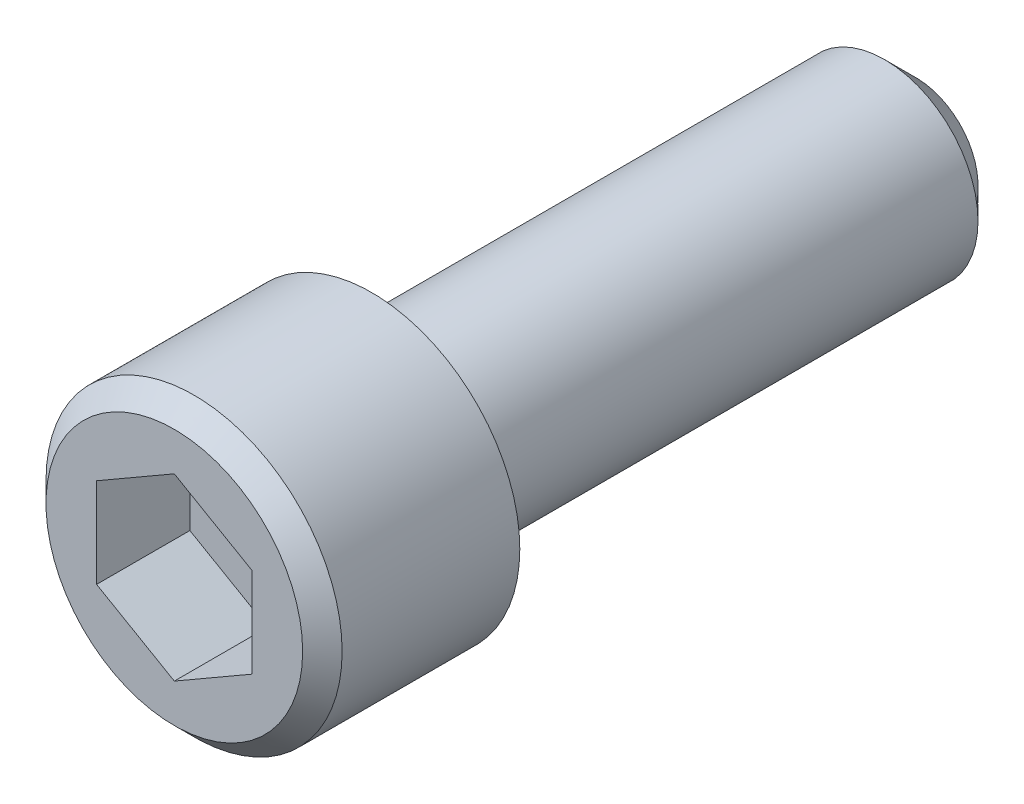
ISO-10303-21;
HEADER;
FILE_DESCRIPTION(('STEP AP214'),'2;1');
FILE_NAME('part.step','',(''),(''),'','','');
FILE_SCHEMA(('AUTOMOTIVE_DESIGN { 1 0 10303 214 1 1 1 1 }'));
ENDSEC;
DATA;
#1=APPLICATION_CONTEXT('core data for automotive mechanical design processes');
#2=APPLICATION_PROTOCOL_DEFINITION('international standard','automotive_design',2000,#1);
#3=PRODUCT_CONTEXT('',#1,'mechanical');
#4=PRODUCT('Part','Part','',(#3));
#5=PRODUCT_RELATED_PRODUCT_CATEGORY('part','',(#4));
#6=PRODUCT_DEFINITION_FORMATION('','',#4);
#7=PRODUCT_DEFINITION_CONTEXT('part definition',#1,'design');
#8=PRODUCT_DEFINITION('design','',#6,#7);
#9=PRODUCT_DEFINITION_SHAPE('','',#8);
#10=(LENGTH_UNIT() NAMED_UNIT(*) SI_UNIT(.MILLI.,.METRE.));
#11=(NAMED_UNIT(*) PLANE_ANGLE_UNIT() SI_UNIT($,.RADIAN.));
#12=(NAMED_UNIT(*) SI_UNIT($,.STERADIAN.) SOLID_ANGLE_UNIT());
#13=UNCERTAINTY_MEASURE_WITH_UNIT(LENGTH_MEASURE(1.E-05),#10,'distance_accuracy_value','');
#14=(GEOMETRIC_REPRESENTATION_CONTEXT(3) GLOBAL_UNCERTAINTY_ASSIGNED_CONTEXT((#13)) GLOBAL_UNIT_ASSIGNED_CONTEXT((#10,
#11,#12)) REPRESENTATION_CONTEXT('',''));
#15=CARTESIAN_POINT('',(0.,0.,0.));
#16=DIRECTION('',(0.,0.,1.));
#17=DIRECTION('',(1.,0.,0.));
#18=AXIS2_PLACEMENT_3D('',#15,#16,#17);
#19=CARTESIAN_POINT('',(0.,0.,-40.));
#20=DIRECTION('',(0.,0.,1.));
#21=DIRECTION('',(1.,0.,0.));
#22=AXIS2_PLACEMENT_3D('',#19,#20,#21);
#23=CYLINDRICAL_SURFACE('',#22,6.);
#24=CARTESIAN_POINT('',(0.,0.,-33.));
#25=DIRECTION('',(0.,0.,-1.));
#26=DIRECTION('',(-1.,0.,0.));
#27=AXIS2_PLACEMENT_3D('',#24,#25,#26);
#28=CIRCLE('',#27,6.);
#29=CARTESIAN_POINT('',(-6.,0.,-33.));
#30=VERTEX_POINT('',#29);
#31=EDGE_CURVE('E9',#30,#30,#28,.F.);
#32=ORIENTED_EDGE('',*,*,#31,.T.);
#33=EDGE_LOOP('',(#32));
#34=FACE_BOUND('',#33,.T.);
#35=CARTESIAN_POINT('',(0.,0.,0.));
#36=DIRECTION('',(0.,0.,-1.));
#37=DIRECTION('',(-1.,0.,0.));
#38=AXIS2_PLACEMENT_3D('',#35,#36,#37);
#39=CIRCLE('',#38,6.);
#40=CARTESIAN_POINT('',(-6.,0.,0.));
#41=VERTEX_POINT('',#40);
#42=EDGE_CURVE('E116',#41,#41,#39,.T.);
#43=ORIENTED_EDGE('',*,*,#42,.T.);
#44=EDGE_LOOP('',(#43));
#45=FACE_BOUND('',#44,.T.);
#46=ADVANCED_FACE('F14',(#34,#45),#23,.T.);
#47=CARTESIAN_POINT('',(0.,0.,12.7));
#48=DIRECTION('',(0.,0.,1.));
#49=DIRECTION('',(1.,0.,0.));
#50=AXIS2_PLACEMENT_3D('',#47,#48,#49);
#51=PLANE('',#50);
#52=DIRECTION('',(0.866025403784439,-0.5,0.));
#53=VECTOR('',#52,1.);
#54=CARTESIAN_POINT('',(-5.,-2.88675134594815,12.7));
#55=LINE('',#54,#53);
#56=CARTESIAN_POINT('',(-5.,-2.88675134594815,12.7));
#57=VERTEX_POINT('',#56);
#58=CARTESIAN_POINT('',(0.,-5.77350269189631,12.7));
#59=VERTEX_POINT('',#58);
#60=EDGE_CURVE('E29',#57,#59,#55,.T.);
#61=ORIENTED_EDGE('',*,*,#60,.F.);
#62=DIRECTION('',(0.,-1.,0.));
#63=VECTOR('',#62,1.);
#64=CARTESIAN_POINT('',(-5.,2.88675134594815,12.7));
#65=LINE('',#64,#63);
#66=CARTESIAN_POINT('',(-5.,2.88675134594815,12.7));
#67=VERTEX_POINT('',#66);
#68=EDGE_CURVE('E112',#67,#57,#65,.T.);
#69=ORIENTED_EDGE('',*,*,#68,.F.);
#70=DIRECTION('',(-0.866025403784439,-0.5,0.));
#71=VECTOR('',#70,1.);
#72=CARTESIAN_POINT('',(0.,5.77350269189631,12.7));
#73=LINE('',#72,#71);
#74=CARTESIAN_POINT('',(0.,5.77350269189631,12.7));
#75=VERTEX_POINT('',#74);
#76=EDGE_CURVE('E110',#75,#67,#73,.T.);
#77=ORIENTED_EDGE('',*,*,#76,.F.);
#78=DIRECTION('',(-0.866025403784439,0.5,0.));
#79=VECTOR('',#78,1.);
#80=CARTESIAN_POINT('',(5.,2.88675134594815,12.7));
#81=LINE('',#80,#79);
#82=CARTESIAN_POINT('',(5.,2.88675134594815,12.7));
#83=VERTEX_POINT('',#82);
#84=EDGE_CURVE('E77',#83,#75,#81,.T.);
#85=ORIENTED_EDGE('',*,*,#84,.F.);
#86=DIRECTION('',(0.,1.,0.));
#87=VECTOR('',#86,1.);
#88=CARTESIAN_POINT('',(5.,-2.88675134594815,12.7));
#89=LINE('',#88,#87);
#90=CARTESIAN_POINT('',(5.,-2.88675134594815,12.7));
#91=VERTEX_POINT('',#90);
#92=EDGE_CURVE('E106',#91,#83,#89,.T.);
#93=ORIENTED_EDGE('',*,*,#92,.F.);
#94=DIRECTION('',(0.866025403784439,0.5,0.));
#95=VECTOR('',#94,1.);
#96=CARTESIAN_POINT('',(0.,-5.77350269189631,12.7));
#97=LINE('',#96,#95);
#98=EDGE_CURVE('E103',#59,#91,#97,.T.);
#99=ORIENTED_EDGE('',*,*,#98,.F.);
#100=EDGE_LOOP('',(#61,#69,#77,#85,#93,#99));
#101=FACE_BOUND('',#100,.T.);
#102=CARTESIAN_POINT('',(0.,0.,12.7));
#103=DIRECTION('',(0.,0.,1.));
#104=DIRECTION('',(1.,0.,0.));
#105=AXIS2_PLACEMENT_3D('',#102,#103,#104);
#106=CIRCLE('',#105,8.255);
#107=CARTESIAN_POINT('',(8.255,0.,12.7));
#108=VERTEX_POINT('',#107);
#109=EDGE_CURVE('E124',#108,#108,#106,.T.);
#110=ORIENTED_EDGE('',*,*,#109,.T.);
#111=EDGE_LOOP('',(#110));
#112=FACE_BOUND('',#111,.T.);
#113=ADVANCED_FACE('F147',(#101,#112),#51,.T.);
#114=CARTESIAN_POINT('',(0.,9.525,0.));
#115=DIRECTION('',(0.,0.,-1.));
#116=DIRECTION('',(-1.,0.,0.));
#117=AXIS2_PLACEMENT_3D('',#114,#115,#116);
#118=PLANE('',#117);
#119=CARTESIAN_POINT('',(0.,0.,0.));
#120=DIRECTION('',(0.,0.,1.));
#121=DIRECTION('',(1.,0.,0.));
#122=AXIS2_PLACEMENT_3D('',#119,#120,#121);
#123=CIRCLE('',#122,9.525);
#124=CARTESIAN_POINT('',(9.525,0.,0.));
#125=VERTEX_POINT('',#124);
#126=EDGE_CURVE('E130',#125,#125,#123,.T.);
#127=ORIENTED_EDGE('',*,*,#126,.F.);
#128=EDGE_LOOP('',(#127));
#129=FACE_BOUND('',#128,.T.);
#130=ORIENTED_EDGE('',*,*,#42,.F.);
#131=EDGE_LOOP('',(#130));
#132=FACE_BOUND('',#131,.T.);
#133=ADVANCED_FACE('F154',(#129,#132),#118,.T.);
#134=CARTESIAN_POINT('',(0.,0.,44.45));
#135=DIRECTION('',(0.,0.,1.));
#136=DIRECTION('',(1.,0.,0.));
#137=AXIS2_PLACEMENT_3D('',#134,#135,#136);
#138=CYLINDRICAL_SURFACE('',#137,9.525);
#139=ORIENTED_EDGE('',*,*,#126,.T.);
#140=EDGE_LOOP('',(#139));
#141=FACE_BOUND('',#140,.T.);
#142=CARTESIAN_POINT('',(0.,0.,11.43));
#143=DIRECTION('',(0.,0.,1.));
#144=DIRECTION('',(1.,0.,0.));
#145=AXIS2_PLACEMENT_3D('',#142,#143,#144);
#146=CIRCLE('',#145,9.525);
#147=CARTESIAN_POINT('',(9.525,0.,11.43));
#148=VERTEX_POINT('',#147);
#149=EDGE_CURVE('E127',#148,#148,#146,.T.);
#150=ORIENTED_EDGE('',*,*,#149,.F.);
#151=EDGE_LOOP('',(#150));
#152=FACE_BOUND('',#151,.T.);
#153=ADVANCED_FACE('F165',(#141,#152),#138,.T.);
#154=CARTESIAN_POINT('',(0.,0.,12.7));
#155=DIRECTION('',(0.,0.,-1.));
#156=DIRECTION('',(-1.,0.,0.));
#157=AXIS2_PLACEMENT_3D('',#154,#155,#156);
#158=CONICAL_SURFACE('',#157,8.255,0.78539816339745);
#159=ORIENTED_EDGE('',*,*,#149,.T.);
#160=EDGE_LOOP('',(#159));
#161=FACE_BOUND('',#160,.T.);
#162=ORIENTED_EDGE('',*,*,#109,.F.);
#163=EDGE_LOOP('',(#162));
#164=FACE_BOUND('',#163,.T.);
#165=ADVANCED_FACE('F162',(#161,#164),#158,.T.);
#166=CARTESIAN_POINT('',(-5.,-2.88675134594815,6.7));
#167=DIRECTION('',(-0.5,-0.866025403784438,0.));
#168=DIRECTION('',(0.866025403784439,-0.5,0.));
#169=AXIS2_PLACEMENT_3D('',#166,#167,#168);
#170=PLANE('',#169);
#171=ORIENTED_EDGE('',*,*,#60,.T.);
#172=DIRECTION('',(0.,0.,1.));
#173=VECTOR('',#172,1.);
#174=CARTESIAN_POINT('',(0.,-5.77350269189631,6.7));
#175=LINE('',#174,#173);
#176=CARTESIAN_POINT('',(0.,-5.77350269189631,6.7));
#177=VERTEX_POINT('',#176);
#178=EDGE_CURVE('E59',#177,#59,#175,.T.);
#179=ORIENTED_EDGE('',*,*,#178,.F.);
#180=DIRECTION('',(0.866025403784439,-0.5,0.));
#181=VECTOR('',#180,1.);
#182=CARTESIAN_POINT('',(-5.,-2.88675134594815,6.7));
#183=LINE('',#182,#181);
#184=CARTESIAN_POINT('',(-5.,-2.88675134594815,6.7));
#185=VERTEX_POINT('',#184);
#186=EDGE_CURVE('E114',#185,#177,#183,.T.);
#187=ORIENTED_EDGE('',*,*,#186,.F.);
#188=DIRECTION('',(0.,0.,1.));
#189=VECTOR('',#188,1.);
#190=CARTESIAN_POINT('',(-5.,-2.88675134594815,6.7));
#191=LINE('',#190,#189);
#192=EDGE_CURVE('E37',#185,#57,#191,.T.);
#193=ORIENTED_EDGE('',*,*,#192,.T.);
#194=EDGE_LOOP('',(#171,#179,#187,#193));
#195=FACE_BOUND('',#194,.T.);
#196=ADVANCED_FACE('F159',(#195),#170,.F.);
#197=CARTESIAN_POINT('',(-5.,2.88675134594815,6.7));
#198=DIRECTION('',(-1.,0.,0.));
#199=DIRECTION('',(0.,0.,1.));
#200=AXIS2_PLACEMENT_3D('',#197,#198,#199);
#201=PLANE('',#200);
#202=ORIENTED_EDGE('',*,*,#68,.T.);
#203=ORIENTED_EDGE('',*,*,#192,.F.);
#204=DIRECTION('',(0.,-1.,0.));
#205=VECTOR('',#204,1.);
#206=CARTESIAN_POINT('',(-5.,2.88675134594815,6.7));
#207=LINE('',#206,#205);
#208=CARTESIAN_POINT('',(-5.,2.88675134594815,6.7));
#209=VERTEX_POINT('',#208);
#210=EDGE_CURVE('E89',#209,#185,#207,.T.);
#211=ORIENTED_EDGE('',*,*,#210,.F.);
#212=DIRECTION('',(0.,0.,1.));
#213=VECTOR('',#212,1.);
#214=CARTESIAN_POINT('',(-5.,2.88675134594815,6.7));
#215=LINE('',#214,#213);
#216=EDGE_CURVE('E81',#209,#67,#215,.T.);
#217=ORIENTED_EDGE('',*,*,#216,.T.);
#218=EDGE_LOOP('',(#202,#203,#211,#217));
#219=FACE_BOUND('',#218,.T.);
#220=ADVANCED_FACE('F205',(#219),#201,.F.);
#221=CARTESIAN_POINT('',(0.,5.77350269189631,6.7));
#222=DIRECTION('',(-0.5,0.866025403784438,0.));
#223=DIRECTION('',(-0.866025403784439,-0.5,0.));
#224=AXIS2_PLACEMENT_3D('',#221,#222,#223);
#225=PLANE('',#224);
#226=ORIENTED_EDGE('',*,*,#76,.T.);
#227=ORIENTED_EDGE('',*,*,#216,.F.);
#228=DIRECTION('',(-0.866025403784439,-0.5,0.));
#229=VECTOR('',#228,1.);
#230=CARTESIAN_POINT('',(0.,5.77350269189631,6.7));
#231=LINE('',#230,#229);
#232=CARTESIAN_POINT('',(0.,5.77350269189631,6.7));
#233=VERTEX_POINT('',#232);
#234=EDGE_CURVE('E85',#233,#209,#231,.T.);
#235=ORIENTED_EDGE('',*,*,#234,.F.);
#236=DIRECTION('',(0.,0.,1.));
#237=VECTOR('',#236,1.);
#238=CARTESIAN_POINT('',(0.,5.77350269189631,6.7));
#239=LINE('',#238,#237);
#240=EDGE_CURVE('E70',#233,#75,#239,.T.);
#241=ORIENTED_EDGE('',*,*,#240,.T.);
#242=EDGE_LOOP('',(#226,#227,#235,#241));
#243=FACE_BOUND('',#242,.T.);
#244=ADVANCED_FACE('F86',(#243),#225,.F.);
#245=CARTESIAN_POINT('',(5.,2.88675134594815,6.7));
#246=DIRECTION('',(0.5,0.866025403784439,0.));
#247=DIRECTION('',(-0.866025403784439,0.5,0.));
#248=AXIS2_PLACEMENT_3D('',#245,#246,#247);
#249=PLANE('',#248);
#250=ORIENTED_EDGE('',*,*,#84,.T.);
#251=ORIENTED_EDGE('',*,*,#240,.F.);
#252=DIRECTION('',(-0.866025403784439,0.5,0.));
#253=VECTOR('',#252,1.);
#254=CARTESIAN_POINT('',(5.,2.88675134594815,6.7));
#255=LINE('',#254,#253);
#256=CARTESIAN_POINT('',(5.,2.88675134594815,6.7));
#257=VERTEX_POINT('',#256);
#258=EDGE_CURVE('E74',#257,#233,#255,.T.);
#259=ORIENTED_EDGE('',*,*,#258,.F.);
#260=DIRECTION('',(0.,0.,1.));
#261=VECTOR('',#260,1.);
#262=CARTESIAN_POINT('',(5.,2.88675134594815,6.7));
#263=LINE('',#262,#261);
#264=EDGE_CURVE('E82',#257,#83,#263,.T.);
#265=ORIENTED_EDGE('',*,*,#264,.T.);
#266=EDGE_LOOP('',(#250,#251,#259,#265));
#267=FACE_BOUND('',#266,.T.);
#268=ADVANCED_FACE('F72',(#267),#249,.F.);
#269=CARTESIAN_POINT('',(5.,-2.88675134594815,6.7));
#270=DIRECTION('',(1.,0.,0.));
#271=DIRECTION('',(0.,1.,0.));
#272=AXIS2_PLACEMENT_3D('',#269,#270,#271);
#273=PLANE('',#272);
#274=ORIENTED_EDGE('',*,*,#92,.T.);
#275=ORIENTED_EDGE('',*,*,#264,.F.);
#276=DIRECTION('',(0.,1.,0.));
#277=VECTOR('',#276,1.);
#278=CARTESIAN_POINT('',(5.,-2.88675134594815,6.7));
#279=LINE('',#278,#277);
#280=CARTESIAN_POINT('',(5.,-2.88675134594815,6.7));
#281=VERTEX_POINT('',#280);
#282=EDGE_CURVE('E95',#281,#257,#279,.T.);
#283=ORIENTED_EDGE('',*,*,#282,.F.);
#284=DIRECTION('',(0.,0.,1.));
#285=VECTOR('',#284,1.);
#286=CARTESIAN_POINT('',(5.,-2.88675134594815,6.7));
#287=LINE('',#286,#285);
#288=EDGE_CURVE('E119',#281,#91,#287,.T.);
#289=ORIENTED_EDGE('',*,*,#288,.T.);
#290=EDGE_LOOP('',(#274,#275,#283,#289));
#291=FACE_BOUND('',#290,.T.);
#292=ADVANCED_FACE('F226',(#291),#273,.F.);
#293=CARTESIAN_POINT('',(0.,-5.77350269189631,6.7));
#294=DIRECTION('',(0.5,-0.866025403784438,0.));
#295=DIRECTION('',(0.866025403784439,0.5,0.));
#296=AXIS2_PLACEMENT_3D('',#293,#294,#295);
#297=PLANE('',#296);
#298=ORIENTED_EDGE('',*,*,#98,.T.);
#299=ORIENTED_EDGE('',*,*,#288,.F.);
#300=DIRECTION('',(0.866025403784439,0.5,0.));
#301=VECTOR('',#300,1.);
#302=CARTESIAN_POINT('',(0.,-5.77350269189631,6.7));
#303=LINE('',#302,#301);
#304=EDGE_CURVE('E97',#177,#281,#303,.T.);
#305=ORIENTED_EDGE('',*,*,#304,.F.);
#306=ORIENTED_EDGE('',*,*,#178,.T.);
#307=EDGE_LOOP('',(#298,#299,#305,#306));
#308=FACE_BOUND('',#307,.T.);
#309=ADVANCED_FACE('F234',(#308),#297,.F.);
#310=CARTESIAN_POINT('',(0.,0.,6.7));
#311=DIRECTION('',(0.,0.,1.));
#312=DIRECTION('',(1.,0.,0.));
#313=AXIS2_PLACEMENT_3D('',#310,#311,#312);
#314=PLANE('',#313);
#315=ORIENTED_EDGE('',*,*,#186,.T.);
#316=ORIENTED_EDGE('',*,*,#304,.T.);
#317=ORIENTED_EDGE('',*,*,#282,.T.);
#318=ORIENTED_EDGE('',*,*,#258,.T.);
#319=ORIENTED_EDGE('',*,*,#234,.T.);
#320=ORIENTED_EDGE('',*,*,#210,.T.);
#321=EDGE_LOOP('',(#315,#316,#317,#318,#319,#320));
#322=FACE_BOUND('',#321,.T.);
#323=ADVANCED_FACE('F92',(#322),#314,.T.);
#324=CARTESIAN_POINT('',(0.,0.,-35.));
#325=DIRECTION('',(0.,0.,-1.));
#326=DIRECTION('',(-1.,0.,0.));
#327=AXIS2_PLACEMENT_3D('',#324,#325,#326);
#328=PLANE('',#327);
#329=CARTESIAN_POINT('',(0.,0.,-35.));
#330=DIRECTION('',(0.,0.,-1.));
#331=DIRECTION('',(-1.,0.,0.));
#332=AXIS2_PLACEMENT_3D('',#329,#330,#331);
#333=CIRCLE('',#332,4.);
#334=CARTESIAN_POINT('',(-4.,0.,-35.));
#335=VERTEX_POINT('',#334);
#336=EDGE_CURVE('E22',#335,#335,#333,.T.);
#337=ORIENTED_EDGE('',*,*,#336,.T.);
#338=EDGE_LOOP('',(#337));
#339=FACE_BOUND('',#338,.T.);
#340=ADVANCED_FACE('F135',(#339),#328,.T.);
#341=CARTESIAN_POINT('',(0.,0.,-35.));
#342=DIRECTION('',(0.,0.,1.));
#343=DIRECTION('',(1.,0.,0.));
#344=AXIS2_PLACEMENT_3D('',#341,#342,#343);
#345=CONICAL_SURFACE('',#344,4.,0.785398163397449);
#346=ORIENTED_EDGE('',*,*,#31,.F.);
#347=EDGE_LOOP('',(#346));
#348=FACE_BOUND('',#347,.T.);
#349=ORIENTED_EDGE('',*,*,#336,.F.);
#350=EDGE_LOOP('',(#349));
#351=FACE_BOUND('',#350,.T.);
#352=ADVANCED_FACE('F16',(#348,#351),#345,.T.);
#353=CLOSED_SHELL('',(#46,#113,#133,#153,#165,#196,#220,#244,#268,#292,#309,#323,#340,#352));
#354=MANIFOLD_SOLID_BREP('B1',#353);
#355=ADVANCED_BREP_SHAPE_REPRESENTATION('',(#18,#354),#14);
#356=SHAPE_DEFINITION_REPRESENTATION(#9,#355);
ENDSEC;
END-ISO-10303-21;
